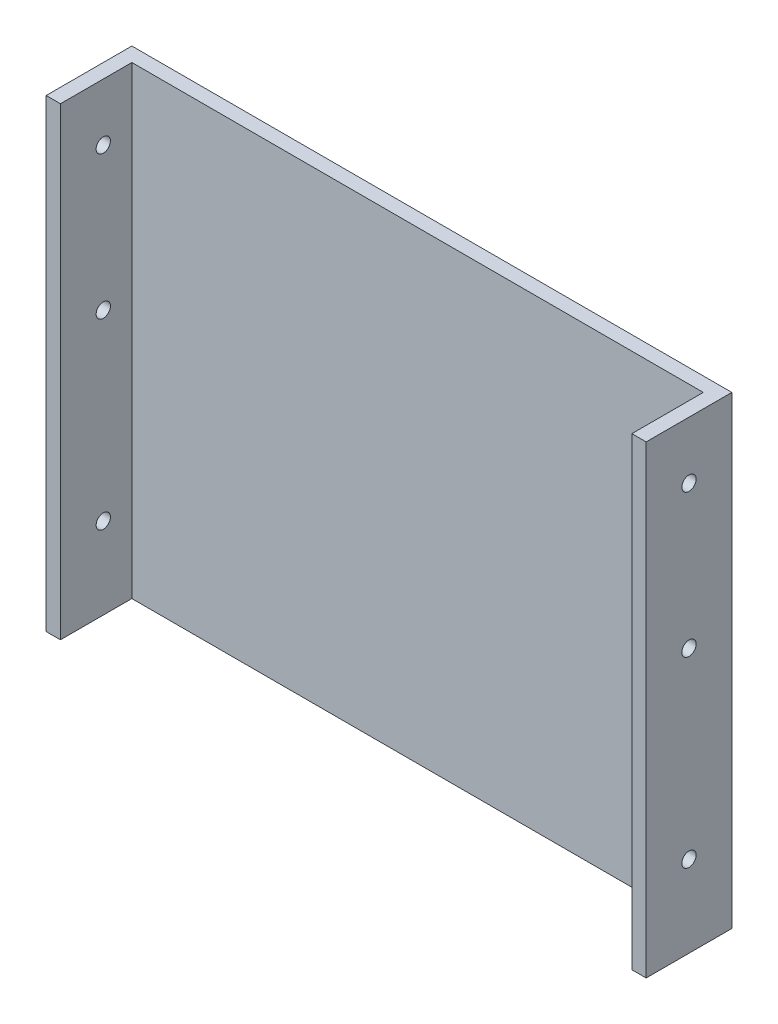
from build123d import *

# Parameters (mm, degrees)
SKETCH_1_W          = 84
SKETCH_1_H          = 65
EXTRUDE_1_DEPTH     = 2
SKETCH_2_W          = 2
SKETCH_2_H          = 65
EXTRUDE_2_DEPTH     = 10
SKETCH_3_R          = 1
CUT_EXTRUDE_1_DEPTH = 10


with BuildPart() as part:
    # Sketch 1 → Extrude 1 (new body)
    with BuildSketch(Plane.XY):
        Rectangle(SKETCH_1_W, SKETCH_1_H)
    extrude(amount=EXTRUDE_1_DEPTH)

    # Sketch 2 → Extrude 2 (add)
    with BuildSketch(Plane.XY.offset(2)):
        with Locations((-41, 0)):
            Rectangle(SKETCH_2_W, SKETCH_2_H)
        with Locations((41, 0)):
            Rectangle(SKETCH_2_W, SKETCH_2_H)
    extrude(amount=EXTRUDE_2_DEPTH)

    # Sketch 3 → Cut-Extrude 1 (cut)
    with BuildSketch(Plane(origin=(-40, 0, 0), x_dir=(0, 0, -1), z_dir=(1, 0, 0))):
        with Locations(Location((-6, 4.485352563, 0), (0, 0, 90))):
            Circle(SKETCH_3_R)
        with Locations(Location((-6, -21.095145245, 0), (0, 0, 90))):
            Circle(SKETCH_3_R)
        with Locations(Location((-6, 24.5, 0), (0, 0, 90))):
            Circle(SKETCH_3_R)
    cut_extrude_1 = extrude(amount=-CUT_EXTRUDE_1_DEPTH, mode=Mode.SUBTRACT)

    # Mirror 1: Cut-Extrude 1 across plane
    add(cut_extrude_1.mirror(Plane(origin=(0, 0, 0), x_dir=(0, 0, 1), z_dir=(1, 0, 0))), mode=Mode.SUBTRACT)


solid = part.part
